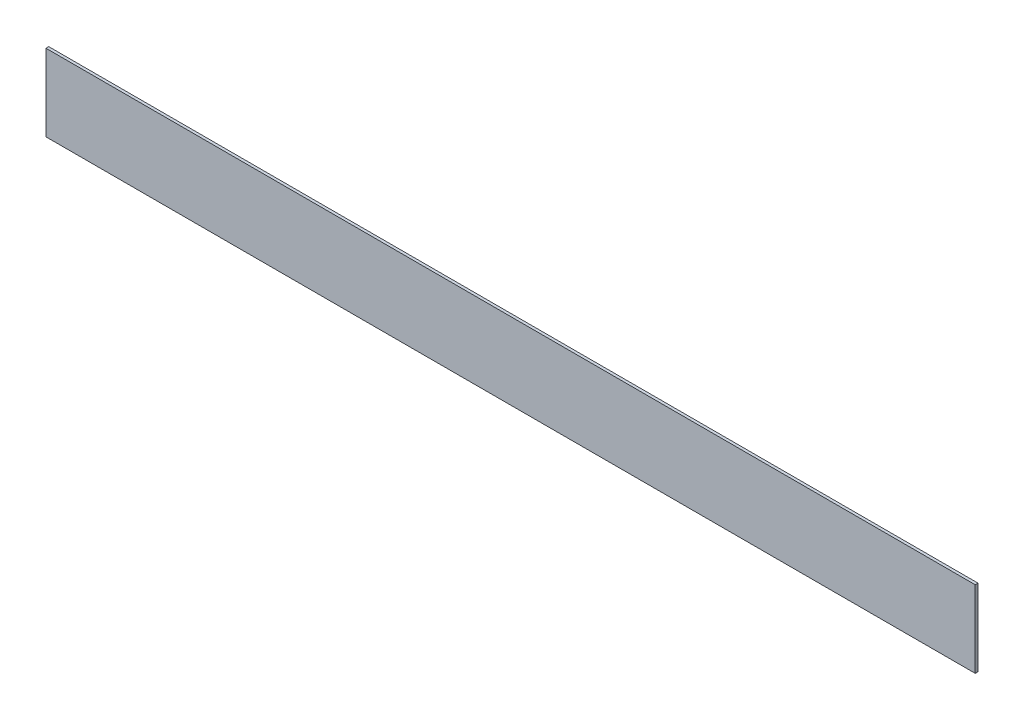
from build123d import *

# Parameters (mm, degrees)
CROQUIS1_W              = 5000
CROQUIS1_H              = 412.97
SALIENTE_EXTRUIR1_DEPTH = 15


with BuildPart() as part:
    # Croquis1 → Saliente-Extruir1 (new body)
    with BuildSketch(Plane.XY):
        with Locations((506.25, 346.64)):
            Rectangle(CROQUIS1_W, CROQUIS1_H)
    extrude(amount=SALIENTE_EXTRUIR1_DEPTH)


solid = part.part
